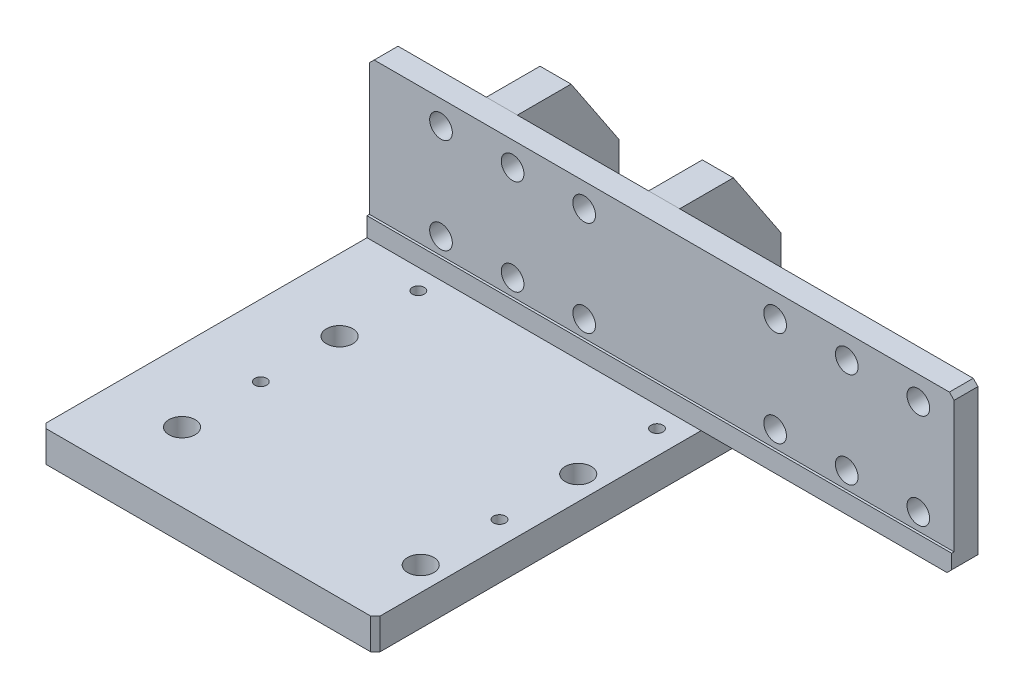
from build123d import *

# Parameters (mm, degrees)
SKETCH_1_W                  = 140
SKETCH_1_H                  = 190
EXTRUDE_1_DEPTH             = 13
SKETCH_2_W                  = 245
SKETCH_2_H                  = 11
EXTRUDE_2_DEPTH             = 65
SKETCH_3_W                  = 13
SKETCH_3_H                  = 42.5
EXTRUDE_3_DEPTH             = 65
EXTRUDE_3_2_DEPTH           = 65
CUT_EXTRUDE_1_DEPTH         = 176.311151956
SKETCH_5_W                  = 245
SKETCH_5_H                  = 57
CUT_EXTRUDE_2_DEPTH         = 1
HOLE_WIZARD_M6_1_AT_2_COUNT = 2
HOLE_WIZARD_M6_1_AT_2_PITCH = 100
HOLE_WIZARD_M6_1_AT_3_COUNT = 2
HOLE_WIZARD_M6_1_AT_3_PITCH = 66
HOLE_WIZARD_M6_1_AT_4_COUNT = 2
HOLE_WIZARD_M6_1_AT_4_PITCH = 132
HOLE_WIZARD_M6_1_AT_5_COUNT = 2
HOLE_WIZARD_M6_1_AT_5_PITCH = 119.816526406
HOLE_WIZARD_M6_1_AT_6_COUNT = 2
HOLE_WIZARD_M6_1_AT_6_PITCH = 165.601932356
SKETCH_9_W                  = 2.5
SKETCH_9_H                  = 13
F_5_0MM_1_AT_2_COUNT        = 2
F_5_0MM_1_AT_2_PITCH        = 100
F_5_0MM_1_AT_3_COUNT        = 2
F_5_0MM_1_AT_3_PITCH        = 66
F_5_0MM_1_AT_4_COUNT        = 2
F_5_0MM_1_AT_4_PITCH        = 119.816526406
HOLE_WIZARD_M5_1_AT_2_COUNT = 2
HOLE_WIZARD_M5_1_AT_2_PITCH = 30
HOLE_WIZARD_M5_1_AT_3_COUNT = 2
HOLE_WIZARD_M5_1_AT_3_PITCH = 60
HOLE_WIZARD_M5_1_AT_4_COUNT = 2
HOLE_WIZARD_M5_1_AT_4_PITCH = 40
HOLE_WIZARD_M5_1_AT_5_COUNT = 2
HOLE_WIZARD_M5_1_AT_5_PITCH = 50
HOLE_WIZARD_M5_1_AT_6_COUNT = 2
HOLE_WIZARD_M5_1_AT_6_PITCH = 72.111025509
PATTERN_LINEAR_1_COUNT      = 2
PATTERN_LINEAR_1_PITCH      = 140
CHAMFER_1_SIZE              = 2
CHAMFER_2_SIZE              = 2


with BuildPart() as part:
    # Sketch 1 → Extrude 1 (new body)
    with BuildSketch(Plane(origin=(0, 0, 0), x_dir=(1, 0, 0), z_dir=(0, 1, 0))):
        Rectangle(SKETCH_1_W, SKETCH_1_H)
    extrude(amount=EXTRUDE_1_DEPTH)

    # Sketch 7 → Hole Wizard M6 _ _ _ _ _1 (revolve, cut)
    with BuildSketch(Plane(origin=(-40, 13, -66), x_dir=(0, 0, 1), z_dir=(1, 0, 0))):
        Polygon((0, 0), (0, 13), (3.3, 13), (3.3, 8), (5.5, 8), (5.5, 0), align=None)
    hole_wizard_m6_1 = revolve(axis=Axis((-40, 19.35, -66), (0, -1, 0)), mode=Mode.SUBTRACT)

    # Hole Wizard M6 _ _ _ _ _1 at 2: Hole Wizard M6 _ _ _ _ _1 ×2
    with Locations(*[(i * HOLE_WIZARD_M6_1_AT_2_PITCH, 0, 0) for i in range(1, HOLE_WIZARD_M6_1_AT_2_COUNT)]):
        add(hole_wizard_m6_1, mode=Mode.SUBTRACT)

    # Hole Wizard M6 _ _ _ _ _1 at 3: Hole Wizard M6 _ _ _ _ _1 ×2
    with Locations(*[(0, 0, i * HOLE_WIZARD_M6_1_AT_3_PITCH) for i in range(1, HOLE_WIZARD_M6_1_AT_3_COUNT)]):
        add(hole_wizard_m6_1, mode=Mode.SUBTRACT)

    # Hole Wizard M6 _ _ _ _ _1 at 4: Hole Wizard M6 _ _ _ _ _1 ×2
    with Locations(*[(0, 0, i * HOLE_WIZARD_M6_1_AT_4_PITCH) for i in range(1, HOLE_WIZARD_M6_1_AT_4_COUNT)]):
        add(hole_wizard_m6_1, mode=Mode.SUBTRACT)

    # Hole Wizard M6 _ _ _ _ _1 at 5: Hole Wizard M6 _ _ _ _ _1 ×2
    with Locations(*[Vector(0.8346094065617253, 0, 0.5508422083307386) * (i * HOLE_WIZARD_M6_1_AT_5_PITCH) for i in range(1, HOLE_WIZARD_M6_1_AT_5_COUNT)]):
        add(hole_wizard_m6_1, mode=Mode.SUBTRACT)

    # Hole Wizard M6 _ _ _ _ _1 at 6: Hole Wizard M6 _ _ _ _ _1 ×2
    with Locations(*[Vector(0.6038576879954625, 0, 0.7970921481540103) * (i * HOLE_WIZARD_M6_1_AT_6_PITCH) for i in range(1, HOLE_WIZARD_M6_1_AT_6_COUNT)]):
        add(hole_wizard_m6_1, mode=Mode.SUBTRACT)

    # Sketch 9 → 5.0mm _ _1 (revolve, cut)
    with BuildSketch(Plane(origin=(-40, 13, -33), x_dir=(0, 0, 1), z_dir=(1, 0, 0))):
        with Locations((1.25, 6.5)):
            Rectangle(SKETCH_9_W, SKETCH_9_H)
    f_5_0mm_1 = revolve(axis=Axis((-40, 19.35, -33), (0, -1, 0)), mode=Mode.SUBTRACT)

    # 5.0mm _ _1 at 2: 5.0mm _ _1 ×2
    with Locations(*[(i * F_5_0MM_1_AT_2_PITCH, 0, 0) for i in range(1, F_5_0MM_1_AT_2_COUNT)]):
        add(f_5_0mm_1, mode=Mode.SUBTRACT)

    # 5.0mm _ _1 at 3: 5.0mm _ _1 ×2
    with Locations(*[(0, 0, i * F_5_0MM_1_AT_3_PITCH) for i in range(1, F_5_0MM_1_AT_3_COUNT)]):
        add(f_5_0mm_1, mode=Mode.SUBTRACT)

    # 5.0mm _ _1 at 4: 5.0mm _ _1 ×2
    with Locations(*[Vector(0.8346094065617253, 0, 0.5508422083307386) * (i * F_5_0MM_1_AT_4_PITCH) for i in range(1, F_5_0MM_1_AT_4_COUNT)]):
        add(f_5_0mm_1, mode=Mode.SUBTRACT)

    # Chamfer 2
    chamfer_2_edges = [part.edges().sort_by_distance(p)[0] for p in [
        (70, 6.5, 95),
        (-70, 6.5, 95),
        (-70, 6.5, -95),
        (70, 6.5, -95),
    ]]
    chamfer(chamfer_2_edges, length=CHAMFER_2_SIZE)


with BuildPart() as body_2:
    # Sketch 2 → Extrude 2 (new body)
    with BuildSketch(Plane(origin=(0, 13, 0), x_dir=(1, 0, 0), z_dir=(0, 1, 0))):
        with Locations((52.5, 47)):
            Rectangle(SKETCH_2_W, SKETCH_2_H)
    extrude(amount=EXTRUDE_2_DEPTH)

    # Sketch 5 → Cut-Extrude 2 (cut)
    with BuildSketch(Plane.XY.offset(-41.5)):
        with Locations((52.5, 49.5)):
            Rectangle(SKETCH_5_W, SKETCH_5_H)
    extrude(amount=-CUT_EXTRUDE_2_DEPTH, mode=Mode.SUBTRACT)

    # Sketch 13 → Hole Wizard M5 _ _ _ _ _1 (revolve, cut)
    with BuildSketch(Plane(origin=(-40, 68, -42.5), x_dir=(0, -1, 0), z_dir=(1, 0, 0))):
        Polygon((0, 0), (0, 52.5), (2.75, 52.5), (2.75, 8), (4.75, 8), (4.75, 0), align=None)
    hole_wizard_m5_1 = revolve(axis=Axis((-40, 68, -36.15), (0, 0, -1)), mode=Mode.SUBTRACT)

    # Hole Wizard M5 _ _ _ _ _1 at 2: Hole Wizard M5 _ _ _ _ _1 ×2
    with Locations(*[(i * HOLE_WIZARD_M5_1_AT_2_PITCH, 0, 0) for i in range(1, HOLE_WIZARD_M5_1_AT_2_COUNT)]):
        add(hole_wizard_m5_1, mode=Mode.SUBTRACT)

    # Hole Wizard M5 _ _ _ _ _1 at 3: Hole Wizard M5 _ _ _ _ _1 ×2
    with Locations(*[(i * HOLE_WIZARD_M5_1_AT_3_PITCH, 0, 0) for i in range(1, HOLE_WIZARD_M5_1_AT_3_COUNT)]):
        add(hole_wizard_m5_1, mode=Mode.SUBTRACT)

    # Hole Wizard M5 _ _ _ _ _1 at 4: Hole Wizard M5 _ _ _ _ _1 ×2
    with Locations(*[(0, -i * HOLE_WIZARD_M5_1_AT_4_PITCH, 0) for i in range(1, HOLE_WIZARD_M5_1_AT_4_COUNT)]):
        add(hole_wizard_m5_1, mode=Mode.SUBTRACT)

    # Hole Wizard M5 _ _ _ _ _1 at 5: Hole Wizard M5 _ _ _ _ _1 ×2
    with Locations(*[Vector(0.6, -0.8, 0) * (i * HOLE_WIZARD_M5_1_AT_5_PITCH) for i in range(1, HOLE_WIZARD_M5_1_AT_5_COUNT)]):
        add(hole_wizard_m5_1, mode=Mode.SUBTRACT)

    # Hole Wizard M5 _ _ _ _ _1 at 6: Hole Wizard M5 _ _ _ _ _1 ×2
    with Locations(*[Vector(0.8320502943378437, -0.5547001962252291, 0) * (i * HOLE_WIZARD_M5_1_AT_6_PITCH) for i in range(1, HOLE_WIZARD_M5_1_AT_6_COUNT)]):
        add(hole_wizard_m5_1, mode=Mode.SUBTRACT)

    # Pattern Linear 1: Hole Wizard M5 _ _ _ _ _1 ×2
    with Locations(*[(i * PATTERN_LINEAR_1_PITCH, 0, 0) for i in range(1, PATTERN_LINEAR_1_COUNT)]):
        add(hole_wizard_m5_1, mode=Mode.SUBTRACT)

    # Pattern Linear 1 copy 1 sketch → Pattern Linear 1 copy 1 (revolve, cut)
    with BuildSketch(Plane(origin=(130, 68, -42.5), x_dir=(0, -1, 0), z_dir=(1, 0, 0))):
        Polygon((0, 0), (0, 52.5), (2.75, 52.5), (2.75, 8), (4.75, 8), (4.75, 0), align=None)
    revolve(axis=Axis((130, 68, -36.15), (0, 0, -1)), mode=Mode.SUBTRACT)

    # Pattern Linear 1 copy 2 sketch → Pattern Linear 1 copy 2 (revolve, cut)
    with BuildSketch(Plane(origin=(160, 68, -42.5), x_dir=(0, -1, 0), z_dir=(1, 0, 0))):
        Polygon((0, 0), (0, 52.5), (2.75, 52.5), (2.75, 8), (4.75, 8), (4.75, 0), align=None)
    revolve(axis=Axis((160, 68, -36.15), (0, 0, -1)), mode=Mode.SUBTRACT)

    # Pattern Linear 1 copy 3 sketch → Pattern Linear 1 copy 3 (revolve, cut)
    with BuildSketch(Plane(origin=(100, 28, -42.5), x_dir=(0, -1, 0), z_dir=(1, 0, 0))):
        Polygon((0, 0), (0, 52.5), (2.75, 52.5), (2.75, 8), (4.75, 8), (4.75, 0), align=None)
    revolve(axis=Axis((100, 28, -36.15), (0, 0, -1)), mode=Mode.SUBTRACT)

    # Pattern Linear 1 copy 4 sketch → Pattern Linear 1 copy 4 (revolve, cut)
    with BuildSketch(Plane(origin=(130, 28, -42.5), x_dir=(0, -1, 0), z_dir=(1, 0, 0))):
        Polygon((0, 0), (0, 52.5), (2.75, 52.5), (2.75, 8), (4.75, 8), (4.75, 0), align=None)
    revolve(axis=Axis((130, 28, -36.15), (0, 0, -1)), mode=Mode.SUBTRACT)

    # Pattern Linear 1 copy 5 sketch → Pattern Linear 1 copy 5 (revolve, cut)
    with BuildSketch(Plane(origin=(160, 28, -42.5), x_dir=(0, -1, 0), z_dir=(1, 0, 0))):
        Polygon((0, 0), (0, 52.5), (2.75, 52.5), (2.75, 8), (4.75, 8), (4.75, 0), align=None)
    revolve(axis=Axis((160, 28, -36.15), (0, 0, -1)), mode=Mode.SUBTRACT)

    # Chamfer 1
    chamfer_1_edges = [body_2.edges().sort_by_distance(p)[0] for p in [
        (-70, 78, -47.5),
        (175, 78, -47.5),
        (175, 13, -47),
    ]]
    chamfer(chamfer_1_edges, length=CHAMFER_1_SIZE)


with BuildPart() as body_3:
    # Sketch 3 → Extrude 3 (new body)
    with BuildSketch(Plane(origin=(0, 13, 0), x_dir=(1, 0, 0), z_dir=(0, 1, 0))):
        with Locations((-24.5, 73.75)):
            Rectangle(SKETCH_3_W, SKETCH_3_H)
    extrude(amount=EXTRUDE_3_DEPTH)


with BuildPart() as body_4:
    # Sketch 3 → Extrude 3 2 (new body)
    with BuildSketch(Plane(origin=(0, 13, 0), x_dir=(1, 0, 0), z_dir=(0, 1, 0))):
        with Locations((43.5, 73.75)):
            Rectangle(SKETCH_3_W, SKETCH_3_H)
    extrude(amount=EXTRUDE_3_2_DEPTH)


with BuildPart() as cut_extrude_1_tool:
    # Sketch 4 → Cut-Extrude 1 (new, through all)
    with BuildSketch(Plane(origin=(50, 0, 0), x_dir=(0, 0, -1), z_dir=(1, 0, 0))):
        Polygon((95, 78), (95, 48), (75, 78), align=None)
    extrude(amount=-CUT_EXTRUDE_1_DEPTH)


with BuildPart() as body_3_1:
    add(body_3.part)

    # Cut-Extrude 1: cut by cut_extrude_1_tool
    add(cut_extrude_1_tool.part, mode=Mode.SUBTRACT)


with BuildPart() as body_4_1:
    add(body_4.part)

    # Cut-Extrude 1: cut by cut_extrude_1_tool
    add(cut_extrude_1_tool.part, mode=Mode.SUBTRACT)


solid = Compound([part.part, body_2.part, body_3_1.part, body_4_1.part])
